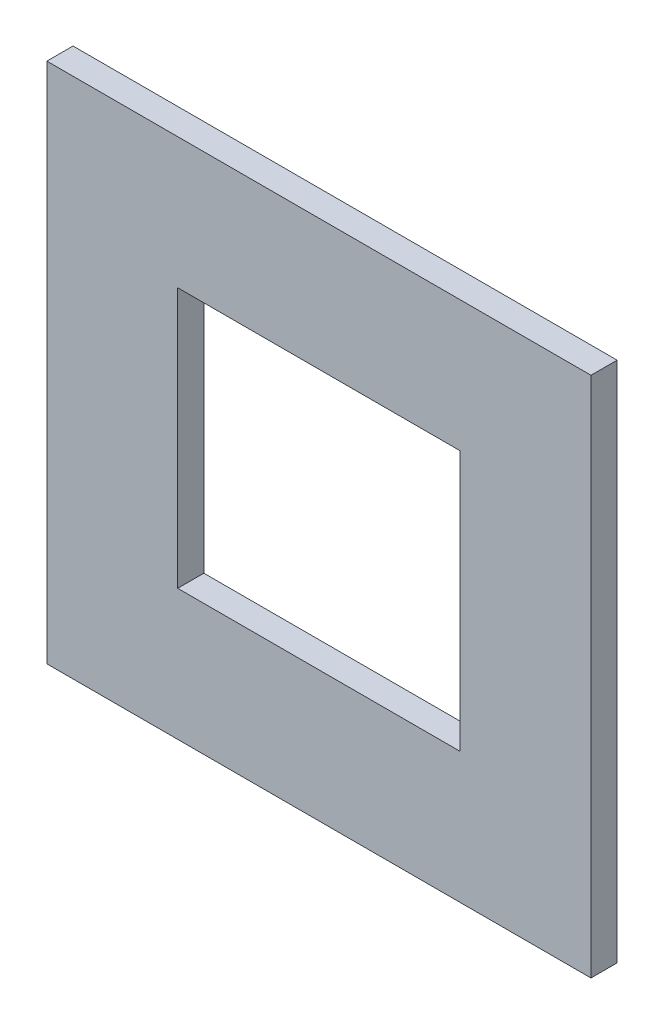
ISO-10303-21;
HEADER;
FILE_DESCRIPTION(('STEP AP214'),'2;1');
FILE_NAME('part.step','',(''),(''),'','','');
FILE_SCHEMA(('AUTOMOTIVE_DESIGN { 1 0 10303 214 1 1 1 1 }'));
ENDSEC;
DATA;
#1=APPLICATION_CONTEXT('core data for automotive mechanical design processes');
#2=APPLICATION_PROTOCOL_DEFINITION('international standard','automotive_design',2000,#1);
#3=PRODUCT_CONTEXT('',#1,'mechanical');
#4=PRODUCT('Part','Part','',(#3));
#5=PRODUCT_RELATED_PRODUCT_CATEGORY('part','',(#4));
#6=PRODUCT_DEFINITION_FORMATION('','',#4);
#7=PRODUCT_DEFINITION_CONTEXT('part definition',#1,'design');
#8=PRODUCT_DEFINITION('design','',#6,#7);
#9=PRODUCT_DEFINITION_SHAPE('','',#8);
#10=(LENGTH_UNIT() NAMED_UNIT(*) SI_UNIT(.MILLI.,.METRE.));
#11=(NAMED_UNIT(*) PLANE_ANGLE_UNIT() SI_UNIT($,.RADIAN.));
#12=(NAMED_UNIT(*) SI_UNIT($,.STERADIAN.) SOLID_ANGLE_UNIT());
#13=UNCERTAINTY_MEASURE_WITH_UNIT(LENGTH_MEASURE(1.E-05),#10,'distance_accuracy_value','');
#14=(GEOMETRIC_REPRESENTATION_CONTEXT(3) GLOBAL_UNCERTAINTY_ASSIGNED_CONTEXT((#13)) GLOBAL_UNIT_ASSIGNED_CONTEXT((#10,
#11,#12)) REPRESENTATION_CONTEXT('',''));
#15=CARTESIAN_POINT('',(0.,0.,0.));
#16=DIRECTION('',(0.,0.,1.));
#17=DIRECTION('',(1.,0.,0.));
#18=AXIS2_PLACEMENT_3D('',#15,#16,#17);
#19=CARTESIAN_POINT('',(0.,0.,15.));
#20=DIRECTION('',(0.,0.,1.));
#21=DIRECTION('',(1.,0.,0.));
#22=AXIS2_PLACEMENT_3D('',#19,#20,#21);
#23=PLANE('',#22);
#24=DIRECTION('',(1.,0.,0.));
#25=VECTOR('',#24,1.);
#26=CARTESIAN_POINT('',(80.9625,-74.6125,15.));
#27=LINE('',#26,#25);
#28=CARTESIAN_POINT('',(-80.9625,-74.6125,15.));
#29=VERTEX_POINT('',#28);
#30=CARTESIAN_POINT('',(80.9625,-74.6125,15.));
#31=VERTEX_POINT('',#30);
#32=EDGE_CURVE('E135',#29,#31,#27,.T.);
#33=ORIENTED_EDGE('',*,*,#32,.F.);
#34=DIRECTION('',(0.,-1.,0.));
#35=VECTOR('',#34,1.);
#36=CARTESIAN_POINT('',(-80.9625,-74.6125,15.));
#37=LINE('',#36,#35);
#38=CARTESIAN_POINT('',(-80.9625,74.6125,15.));
#39=VERTEX_POINT('',#38);
#40=EDGE_CURVE('E133',#39,#29,#37,.T.);
#41=ORIENTED_EDGE('',*,*,#40,.F.);
#42=DIRECTION('',(-1.,0.,0.));
#43=VECTOR('',#42,1.);
#44=CARTESIAN_POINT('',(80.9625,74.6125,15.));
#45=LINE('',#44,#43);
#46=CARTESIAN_POINT('',(80.9625,74.6125,15.));
#47=VERTEX_POINT('',#46);
#48=EDGE_CURVE('E141',#47,#39,#45,.T.);
#49=ORIENTED_EDGE('',*,*,#48,.F.);
#50=DIRECTION('',(0.,1.,0.));
#51=VECTOR('',#50,1.);
#52=CARTESIAN_POINT('',(80.9625,-74.6125,15.));
#53=LINE('',#52,#51);
#54=EDGE_CURVE('E138',#31,#47,#53,.T.);
#55=ORIENTED_EDGE('',*,*,#54,.F.);
#56=EDGE_LOOP('',(#33,#41,#49,#55));
#57=FACE_BOUND('',#56,.T.);
#58=DIRECTION('',(-1.,0.,0.));
#59=VECTOR('',#58,1.);
#60=CARTESIAN_POINT('',(155.9687,-149.6187,15.));
#61=LINE('',#60,#59);
#62=CARTESIAN_POINT('',(155.9687,-149.6187,15.));
#63=VERTEX_POINT('',#62);
#64=CARTESIAN_POINT('',(-155.9687,-149.6187,15.));
#65=VERTEX_POINT('',#64);
#66=EDGE_CURVE('E115',#63,#65,#61,.T.);
#67=ORIENTED_EDGE('',*,*,#66,.F.);
#68=DIRECTION('',(0.,-1.,0.));
#69=VECTOR('',#68,1.);
#70=CARTESIAN_POINT('',(155.9687,149.6187,15.));
#71=LINE('',#70,#69);
#72=CARTESIAN_POINT('',(155.9687,149.6187,15.));
#73=VERTEX_POINT('',#72);
#74=EDGE_CURVE('E49',#73,#63,#71,.T.);
#75=ORIENTED_EDGE('',*,*,#74,.F.);
#76=DIRECTION('',(1.,0.,0.));
#77=VECTOR('',#76,1.);
#78=CARTESIAN_POINT('',(155.9687,149.6187,15.));
#79=LINE('',#78,#77);
#80=CARTESIAN_POINT('',(-155.9687,149.6187,15.));
#81=VERTEX_POINT('',#80);
#82=EDGE_CURVE('E103',#81,#73,#79,.T.);
#83=ORIENTED_EDGE('',*,*,#82,.F.);
#84=DIRECTION('',(0.,1.,0.));
#85=VECTOR('',#84,1.);
#86=CARTESIAN_POINT('',(-155.9687,149.6187,15.));
#87=LINE('',#86,#85);
#88=EDGE_CURVE('E110',#65,#81,#87,.T.);
#89=ORIENTED_EDGE('',*,*,#88,.F.);
#90=EDGE_LOOP('',(#67,#75,#83,#89));
#91=FACE_BOUND('',#90,.T.);
#92=ADVANCED_FACE('F34',(#57,#91),#23,.T.);
#93=CARTESIAN_POINT('',(0.,0.,0.));
#94=DIRECTION('',(0.,0.,1.));
#95=DIRECTION('',(1.,0.,0.));
#96=AXIS2_PLACEMENT_3D('',#93,#94,#95);
#97=PLANE('',#96);
#98=DIRECTION('',(0.,-1.,0.));
#99=VECTOR('',#98,1.);
#100=CARTESIAN_POINT('',(-80.9625,-74.6125,0.));
#101=LINE('',#100,#99);
#102=CARTESIAN_POINT('',(-80.9625,74.6125,0.));
#103=VERTEX_POINT('',#102);
#104=CARTESIAN_POINT('',(-80.9625,-74.6125,0.));
#105=VERTEX_POINT('',#104);
#106=EDGE_CURVE('E130',#103,#105,#101,.T.);
#107=ORIENTED_EDGE('',*,*,#106,.T.);
#108=DIRECTION('',(1.,0.,0.));
#109=VECTOR('',#108,1.);
#110=CARTESIAN_POINT('',(80.9625,-74.6125,0.));
#111=LINE('',#110,#109);
#112=CARTESIAN_POINT('',(80.9625,-74.6125,0.));
#113=VERTEX_POINT('',#112);
#114=EDGE_CURVE('E146',#105,#113,#111,.T.);
#115=ORIENTED_EDGE('',*,*,#114,.T.);
#116=DIRECTION('',(0.,1.,0.));
#117=VECTOR('',#116,1.);
#118=CARTESIAN_POINT('',(80.9625,-74.6125,0.));
#119=LINE('',#118,#117);
#120=CARTESIAN_POINT('',(80.9625,74.6125,0.));
#121=VERTEX_POINT('',#120);
#122=EDGE_CURVE('E149',#113,#121,#119,.T.);
#123=ORIENTED_EDGE('',*,*,#122,.T.);
#124=DIRECTION('',(-1.,0.,0.));
#125=VECTOR('',#124,1.);
#126=CARTESIAN_POINT('',(80.9625,74.6125,0.));
#127=LINE('',#126,#125);
#128=EDGE_CURVE('E136',#121,#103,#127,.T.);
#129=ORIENTED_EDGE('',*,*,#128,.T.);
#130=EDGE_LOOP('',(#107,#115,#123,#129));
#131=FACE_BOUND('',#130,.T.);
#132=DIRECTION('',(0.,-1.,0.));
#133=VECTOR('',#132,1.);
#134=CARTESIAN_POINT('',(155.9687,149.6187,0.));
#135=LINE('',#134,#133);
#136=CARTESIAN_POINT('',(155.9687,149.6187,0.));
#137=VERTEX_POINT('',#136);
#138=CARTESIAN_POINT('',(155.9687,-149.6187,0.));
#139=VERTEX_POINT('',#138);
#140=EDGE_CURVE('E122',#137,#139,#135,.T.);
#141=ORIENTED_EDGE('',*,*,#140,.T.);
#142=DIRECTION('',(-1.,0.,0.));
#143=VECTOR('',#142,1.);
#144=CARTESIAN_POINT('',(155.9687,-149.6187,0.));
#145=LINE('',#144,#143);
#146=CARTESIAN_POINT('',(-155.9687,-149.6187,0.));
#147=VERTEX_POINT('',#146);
#148=EDGE_CURVE('E125',#139,#147,#145,.T.);
#149=ORIENTED_EDGE('',*,*,#148,.T.);
#150=DIRECTION('',(0.,1.,0.));
#151=VECTOR('',#150,1.);
#152=CARTESIAN_POINT('',(-155.9687,149.6187,0.));
#153=LINE('',#152,#151);
#154=CARTESIAN_POINT('',(-155.9687,149.6187,0.));
#155=VERTEX_POINT('',#154);
#156=EDGE_CURVE('E57',#147,#155,#153,.T.);
#157=ORIENTED_EDGE('',*,*,#156,.T.);
#158=DIRECTION('',(1.,0.,0.));
#159=VECTOR('',#158,1.);
#160=CARTESIAN_POINT('',(155.9687,149.6187,0.));
#161=LINE('',#160,#159);
#162=EDGE_CURVE('E105',#155,#137,#161,.T.);
#163=ORIENTED_EDGE('',*,*,#162,.T.);
#164=EDGE_LOOP('',(#141,#149,#157,#163));
#165=FACE_BOUND('',#164,.T.);
#166=ADVANCED_FACE('F36',(#131,#165),#97,.F.);
#167=CARTESIAN_POINT('',(-80.9625,-74.6125,15.));
#168=DIRECTION('',(1.,0.,0.));
#169=DIRECTION('',(0.,1.,0.));
#170=AXIS2_PLACEMENT_3D('',#167,#168,#169);
#171=PLANE('',#170);
#172=ORIENTED_EDGE('',*,*,#106,.F.);
#173=DIRECTION('',(0.,0.,-1.));
#174=VECTOR('',#173,1.);
#175=CARTESIAN_POINT('',(-80.9625,74.6125,15.));
#176=LINE('',#175,#174);
#177=EDGE_CURVE('E143',#39,#103,#176,.T.);
#178=ORIENTED_EDGE('',*,*,#177,.F.);
#179=ORIENTED_EDGE('',*,*,#40,.T.);
#180=DIRECTION('',(0.,0.,-1.));
#181=VECTOR('',#180,1.);
#182=CARTESIAN_POINT('',(-80.9625,-74.6125,15.));
#183=LINE('',#182,#181);
#184=EDGE_CURVE('E11',#29,#105,#183,.T.);
#185=ORIENTED_EDGE('',*,*,#184,.T.);
#186=EDGE_LOOP('',(#172,#178,#179,#185));
#187=FACE_BOUND('',#186,.T.);
#188=ADVANCED_FACE('F171',(#187),#171,.T.);
#189=CARTESIAN_POINT('',(80.9625,-74.6125,15.));
#190=DIRECTION('',(0.,1.,0.));
#191=DIRECTION('',(-1.,0.,0.));
#192=AXIS2_PLACEMENT_3D('',#189,#190,#191);
#193=PLANE('',#192);
#194=ORIENTED_EDGE('',*,*,#114,.F.);
#195=ORIENTED_EDGE('',*,*,#184,.F.);
#196=ORIENTED_EDGE('',*,*,#32,.T.);
#197=DIRECTION('',(0.,0.,-1.));
#198=VECTOR('',#197,1.);
#199=CARTESIAN_POINT('',(80.9625,-74.6125,15.));
#200=LINE('',#199,#198);
#201=EDGE_CURVE('E42',#31,#113,#200,.T.);
#202=ORIENTED_EDGE('',*,*,#201,.T.);
#203=EDGE_LOOP('',(#194,#195,#196,#202));
#204=FACE_BOUND('',#203,.T.);
#205=ADVANCED_FACE('F160',(#204),#193,.T.);
#206=CARTESIAN_POINT('',(80.9625,-74.6125,15.));
#207=DIRECTION('',(-1.,0.,0.));
#208=DIRECTION('',(0.,0.,1.));
#209=AXIS2_PLACEMENT_3D('',#206,#207,#208);
#210=PLANE('',#209);
#211=ORIENTED_EDGE('',*,*,#122,.F.);
#212=ORIENTED_EDGE('',*,*,#201,.F.);
#213=ORIENTED_EDGE('',*,*,#54,.T.);
#214=DIRECTION('',(0.,0.,-1.));
#215=VECTOR('',#214,1.);
#216=CARTESIAN_POINT('',(80.9625,74.6125,15.));
#217=LINE('',#216,#215);
#218=EDGE_CURVE('E156',#47,#121,#217,.T.);
#219=ORIENTED_EDGE('',*,*,#218,.T.);
#220=EDGE_LOOP('',(#211,#212,#213,#219));
#221=FACE_BOUND('',#220,.T.);
#222=ADVANCED_FACE('F165',(#221),#210,.T.);
#223=CARTESIAN_POINT('',(80.9625,74.6125,15.));
#224=DIRECTION('',(0.,-1.,0.));
#225=DIRECTION('',(1.,0.,0.));
#226=AXIS2_PLACEMENT_3D('',#223,#224,#225);
#227=PLANE('',#226);
#228=ORIENTED_EDGE('',*,*,#128,.F.);
#229=ORIENTED_EDGE('',*,*,#218,.F.);
#230=ORIENTED_EDGE('',*,*,#48,.T.);
#231=ORIENTED_EDGE('',*,*,#177,.T.);
#232=EDGE_LOOP('',(#228,#229,#230,#231));
#233=FACE_BOUND('',#232,.T.);
#234=ADVANCED_FACE('F174',(#233),#227,.T.);
#235=CARTESIAN_POINT('',(155.9687,149.6187,15.));
#236=DIRECTION('',(1.,0.,0.));
#237=DIRECTION('',(0.,1.,0.));
#238=AXIS2_PLACEMENT_3D('',#235,#236,#237);
#239=PLANE('',#238);
#240=ORIENTED_EDGE('',*,*,#140,.F.);
#241=DIRECTION('',(0.,0.,-1.));
#242=VECTOR('',#241,1.);
#243=CARTESIAN_POINT('',(155.9687,149.6187,15.));
#244=LINE('',#243,#242);
#245=EDGE_CURVE('E106',#73,#137,#244,.T.);
#246=ORIENTED_EDGE('',*,*,#245,.F.);
#247=ORIENTED_EDGE('',*,*,#74,.T.);
#248=DIRECTION('',(0.,0.,-1.));
#249=VECTOR('',#248,1.);
#250=CARTESIAN_POINT('',(155.9687,-149.6187,15.));
#251=LINE('',#250,#249);
#252=EDGE_CURVE('E117',#63,#139,#251,.T.);
#253=ORIENTED_EDGE('',*,*,#252,.T.);
#254=EDGE_LOOP('',(#240,#246,#247,#253));
#255=FACE_BOUND('',#254,.T.);
#256=ADVANCED_FACE('F190',(#255),#239,.T.);
#257=CARTESIAN_POINT('',(155.9687,149.6187,15.));
#258=DIRECTION('',(0.,1.,0.));
#259=DIRECTION('',(0.,0.,1.));
#260=AXIS2_PLACEMENT_3D('',#257,#258,#259);
#261=PLANE('',#260);
#262=ORIENTED_EDGE('',*,*,#162,.F.);
#263=DIRECTION('',(0.,0.,-1.));
#264=VECTOR('',#263,1.);
#265=CARTESIAN_POINT('',(-155.9687,149.6187,15.));
#266=LINE('',#265,#264);
#267=EDGE_CURVE('E99',#81,#155,#266,.T.);
#268=ORIENTED_EDGE('',*,*,#267,.F.);
#269=ORIENTED_EDGE('',*,*,#82,.T.);
#270=ORIENTED_EDGE('',*,*,#245,.T.);
#271=EDGE_LOOP('',(#262,#268,#269,#270));
#272=FACE_BOUND('',#271,.T.);
#273=ADVANCED_FACE('F101',(#272),#261,.T.);
#274=CARTESIAN_POINT('',(-155.9687,149.6187,15.));
#275=DIRECTION('',(-1.,0.,0.));
#276=DIRECTION('',(0.,-1.,0.));
#277=AXIS2_PLACEMENT_3D('',#274,#275,#276);
#278=PLANE('',#277);
#279=ORIENTED_EDGE('',*,*,#156,.F.);
#280=DIRECTION('',(0.,0.,-1.));
#281=VECTOR('',#280,1.);
#282=CARTESIAN_POINT('',(-155.9687,-149.6187,15.));
#283=LINE('',#282,#281);
#284=EDGE_CURVE('E107',#65,#147,#283,.T.);
#285=ORIENTED_EDGE('',*,*,#284,.F.);
#286=ORIENTED_EDGE('',*,*,#88,.T.);
#287=ORIENTED_EDGE('',*,*,#267,.T.);
#288=EDGE_LOOP('',(#279,#285,#286,#287));
#289=FACE_BOUND('',#288,.T.);
#290=ADVANCED_FACE('F111',(#289),#278,.T.);
#291=CARTESIAN_POINT('',(155.9687,-149.6187,15.));
#292=DIRECTION('',(0.,-1.,0.));
#293=DIRECTION('',(0.,0.,-1.));
#294=AXIS2_PLACEMENT_3D('',#291,#292,#293);
#295=PLANE('',#294);
#296=ORIENTED_EDGE('',*,*,#148,.F.);
#297=ORIENTED_EDGE('',*,*,#252,.F.);
#298=ORIENTED_EDGE('',*,*,#66,.T.);
#299=ORIENTED_EDGE('',*,*,#284,.T.);
#300=EDGE_LOOP('',(#296,#297,#298,#299));
#301=FACE_BOUND('',#300,.T.);
#302=ADVANCED_FACE('F193',(#301),#295,.T.);
#303=CLOSED_SHELL('',(#92,#166,#188,#205,#222,#234,#256,#273,#290,#302));
#304=MANIFOLD_SOLID_BREP('B2',#303);
#305=ADVANCED_BREP_SHAPE_REPRESENTATION('',(#18,#304),#14);
#306=SHAPE_DEFINITION_REPRESENTATION(#9,#305);
ENDSEC;
END-ISO-10303-21;
